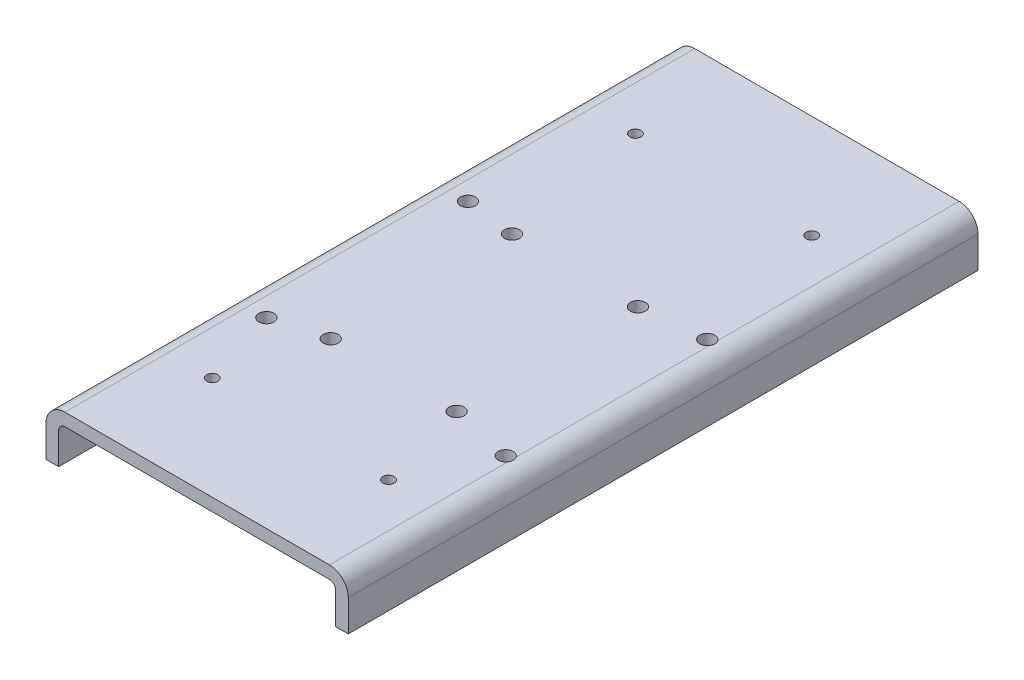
from build123d import *

# Parameters (mm, degrees)
EXTRUSION1_DEPTH                  = 500
TROU_TARAUD_M12X1_751_D           = 10.2
TROU_TARAUD_M12X1_751_CBORE_D     = 12
TROU_TARAUD_M12X1_751_CBORE_DEPTH = 24
R_P_TITION_LIN_AIRE1_COUNT        = 2
R_P_TITION_LIN_AIRE1_PITCH        = 100
R_P_TITION_LIN_AIRE1_COUNT_DIR2   = 2
R_P_TITION_LIN_AIRE1_PITCH_DIR2   = 144
TROU_TARAUD_M12X1_752_D           = 10.2
TROU_TARAUD_M12X1_752_CBORE_D     = 12
TROU_TARAUD_M12X1_752_CBORE_DEPTH = 24
R_P_TITION_LIN_AIRE2_COUNT        = 2
R_P_TITION_LIN_AIRE2_PITCH        = 160
R_P_TITION_LIN_AIRE2_COUNT_DIR2   = 2
R_P_TITION_LIN_AIRE2_PITCH_DIR2   = 190
ESQUISSE6_R                       = 4.5
ENL_V_MAT_EXTRU_1_DEPTH           = 557.057551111


with BuildPart() as part:
    # Esquisse1 → Extrusion1 (new body)
    with BuildSketch(Plane.XY):
        with BuildLine():
            Line((0, 0), (10, 0))
            Line((10, 0), (10, 25))
            ThreePointArc((10, 25), (11.464466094, 28.535533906), (15, 30))
            Line((15, 30), (225, 30))
            ThreePointArc((225, 30), (228.535533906, 28.535533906), (230, 25))
            Line((230, 25), (230, 0))
            Line((230, 0), (240, 0))
            Line((240, 0), (240, 25))
            ThreePointArc((240, 25), (235.606601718, 35.606601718), (225, 40))
            Line((225, 40), (15, 40))
            ThreePointArc((15, 40), (4.393398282, 35.606601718), (0, 25))
            Line((0, 25), (0, 0))
        make_face()
    extrude(amount=EXTRUSION1_DEPTH)

    # Trou taraud_ M12x1.751 (through all)
    with Locations(Plane(origin=(0, 40, 0), x_dir=(-1, 0, 0), z_dir=(0, 1, 0))):
        with Locations((-170, 200)):
            trou_taraud_m12x1_751 = CounterBoreHole(TROU_TARAUD_M12X1_751_D / 2, TROU_TARAUD_M12X1_751_CBORE_D / 2, TROU_TARAUD_M12X1_751_CBORE_DEPTH)

    # R_p_tition lin_aire1: Trou taraud_ M12x1.751 2 × 2
    with Locations(*[(-i * R_P_TITION_LIN_AIRE1_PITCH, 0, j * R_P_TITION_LIN_AIRE1_PITCH_DIR2) for i in range(R_P_TITION_LIN_AIRE1_COUNT) for j in range(R_P_TITION_LIN_AIRE1_COUNT_DIR2) if (i, j) != (0, 0)]):
        add(trou_taraud_m12x1_751, mode=Mode.SUBTRACT)

    # Trou taraud_ M12x1.752 (through all)
    with Locations(Plane(origin=(0, 40, 0), x_dir=(-1, 0, 0), z_dir=(0, 1, 0))):
        with Locations((-30, 195)):
            trou_taraud_m12x1_752 = CounterBoreHole(TROU_TARAUD_M12X1_752_D / 2, TROU_TARAUD_M12X1_752_CBORE_D / 2, TROU_TARAUD_M12X1_752_CBORE_DEPTH)

    # R_p_tition lin_aire2: Trou taraud_ M12x1.752 2 × 2
    with Locations(*[(j * R_P_TITION_LIN_AIRE2_PITCH_DIR2, 0, i * R_P_TITION_LIN_AIRE2_PITCH) for i in range(R_P_TITION_LIN_AIRE2_COUNT) for j in range(R_P_TITION_LIN_AIRE2_COUNT_DIR2) if (i, j) != (0, 0)]):
        add(trou_taraud_m12x1_752, mode=Mode.SUBTRACT)

    # Esquisse6 → Enl_v. mat.-Extru.1 (cut, through all)
    with BuildSketch(Plane(origin=(0, 40, 0), x_dir=(-1, 0, 0), z_dir=(0, 1, 0))):
        with Locations((-50, 82)):
            Circle(ESQUISSE6_R)
        with Locations((-190, 82)):
            Circle(ESQUISSE6_R)
        with Locations((-50, 418)):
            Circle(ESQUISSE6_R)
        with Locations((-190, 418)):
            Circle(ESQUISSE6_R)
    extrude(amount=-ENL_V_MAT_EXTRU_1_DEPTH, mode=Mode.SUBTRACT)


solid = part.part
